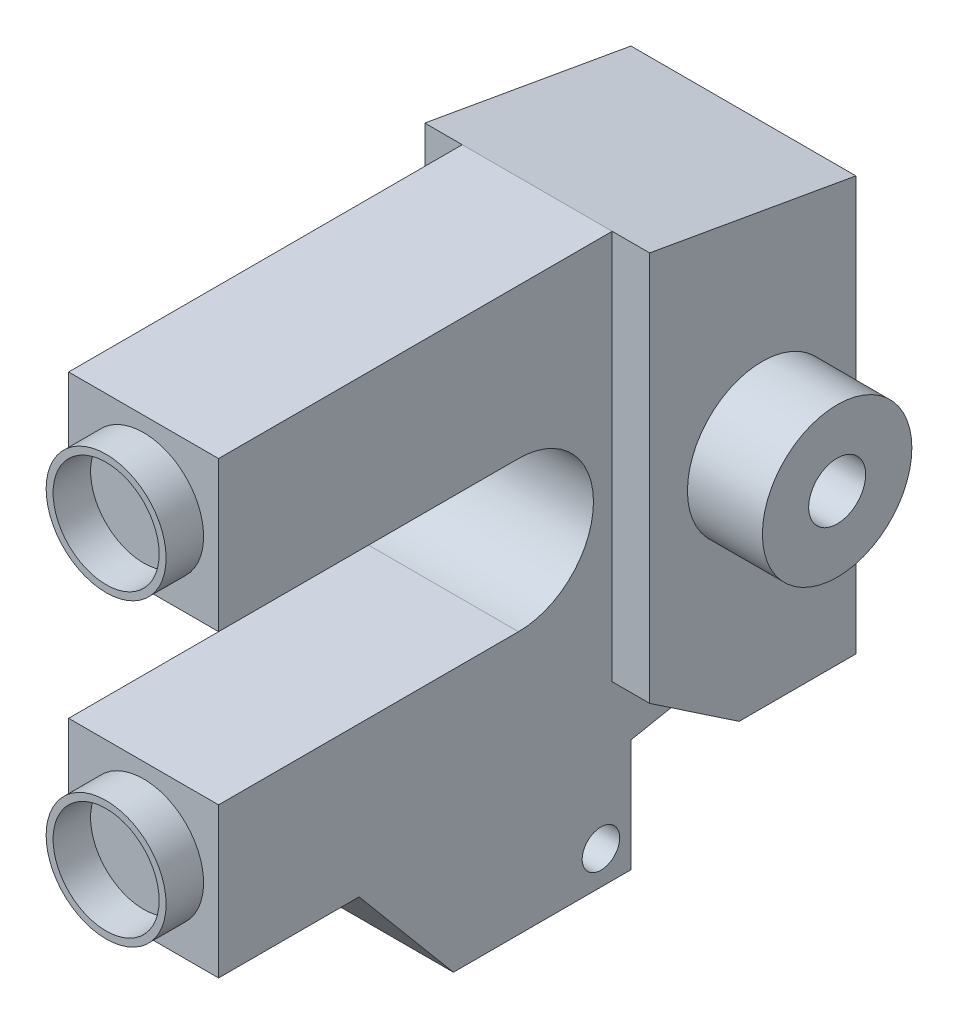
from build123d import *

# Parameters (mm, degrees)
BOSS_EXTRUDE1_DEPTH = 6.35
CUT_EXTRUDE1_DEPTH  = 65.757547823
BOSS_EXTRUDE2_DEPTH = 3.175
SKETCH4_R           = 6.328721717
BOSS_EXTRUDE3_DEPTH = 6.35
SKETCH8_R           = 6.35
BOSS_EXTRUDE5_DEPTH = 6.35
SKETCH9_R           = 2.413
CUT_EXTRUDE4_DEPTH  = 71.995158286
SKETCH12_W          = 6.35
SKETCH12_H          = 12.7
CUT_EXTRUDE5_DEPTH  = 11.1125
SKETCH14_R          = 1.5875
CUT_EXTRUDE6_DEPTH  = 68.277043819
SKETCH15_R          = 5.08
SKETCH15_R_2        = 4.49072
BOSS_EXTRUDE6_DEPTH = 3.175
SKETCH16_R          = 5.08
SKETCH16_R_2        = 4.49072
BOSS_EXTRUDE7_DEPTH = 3.175


with BuildPart() as part:
    # Sketch1 → Boss-Extrude1 (new, symmetric)
    with BuildSketch(Plane(origin=(0, 0, 0), x_dir=(0, 0, -1), z_dir=(1, 0, 0))):
        Polygon((0, 0), (0, 38.1), (33.3375, 38.1), (50.8, 35.020890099), (50.8, 3.085787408), (34.925, 0), (34.925, -9.525), (19.889951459, -9.525), (11.897527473, 0), align=None)
    extrude(amount=BOSS_EXTRUDE1_DEPTH, both=True)

    # Sketch2 → Cut-Extrude1 (cut, through all)
    with BuildSketch(Plane(origin=(6.35, 0, 0), x_dir=(0, 0, -1), z_dir=(1, 0, 0))):
        with BuildLine():
            Line((0, 25.4), (25.4, 25.4))
            ThreePointArc((25.4, 25.4), (31.75, 19.05), (25.4, 12.7))
            Line((25.4, 12.7), (0, 12.7))
            ThreePointArc((0, 12.7), (-6.35, 19.05), (0, 25.4))
        make_face()
    extrude(amount=-CUT_EXTRUDE1_DEPTH, mode=Mode.SUBTRACT)

    # Sketch3 → Boss-Extrude2 (add)
    with BuildSketch(Plane(origin=(6.35, 0, 0), x_dir=(0, 0, -1), z_dir=(1, 0, 0))):
        Polygon((33.3375, 38.1), (33.3375, 5.060292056), (40.906631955, -0.045151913), (50.8, -0.045151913), (50.8, 35.020890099), align=None)
    boss_extrude2 = extrude(amount=BOSS_EXTRUDE2_DEPTH)

    # Sketch4 → Boss-Extrude3 (add)
    with BuildSketch(Plane(origin=(9.525, 0, 0), x_dir=(0, 0, -1), z_dir=(1, 0, 0))):
        with Locations(Location((42.8625, 19.05, 0), (0, 0, 180))):
            Circle(SKETCH4_R)
    extrude(amount=BOSS_EXTRUDE3_DEPTH)

    # Mirror1: Boss-Extrude2 across plane
    add(boss_extrude2.mirror(Plane.ZY))

    # Sketch8 → Boss-Extrude5 (add)
    with BuildSketch(Plane.ZY.offset(9.525)):
        with Locations(Location((-42.8625, 19.05, 0), (0, 0, 180))):
            Circle(SKETCH8_R)
    extrude(amount=BOSS_EXTRUDE5_DEPTH)

    # Sketch9 → Cut-Extrude4 (cut, through all)
    with BuildSketch(Plane.ZY.offset(15.875)):
        with Locations((-42.8625, 19.05)):
            Circle(SKETCH9_R)
    extrude(amount=-CUT_EXTRUDE4_DEPTH, mode=Mode.SUBTRACT)

    # Sketch12 → Cut-Extrude5 (cut)
    with BuildSketch(Plane.XZ.offset(9.525)):
        with Locations((0, -28.575)):
            Rectangle(SKETCH12_W, SKETCH12_H)
    extrude(amount=-CUT_EXTRUDE5_DEPTH, mode=Mode.SUBTRACT)

    # Sketch14 → Cut-Extrude6 (cut, through all)
    with BuildSketch(Plane(origin=(6.35, 0, 0), x_dir=(0, 0, -1), z_dir=(1, 0, 0))):
        with Locations(Location((32.383975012, -6.697965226, 0), (0, 0, 180))):
            Circle(SKETCH14_R)
    extrude(amount=-CUT_EXTRUDE6_DEPTH, mode=Mode.SUBTRACT)

    # Sketch15 → Boss-Extrude6 (add)
    with BuildSketch(Plane.XY):
        with Locations(Location((0, 31.75, 0), (0, 0, 180))):
            Circle(SKETCH15_R)
        with Locations((0, 31.75)):
            Circle(SKETCH15_R_2, mode=Mode.SUBTRACT)
    extrude(amount=BOSS_EXTRUDE6_DEPTH)

    # Sketch16 → Boss-Extrude7 (add)
    with BuildSketch(Plane.XY):
        with Locations(Location((0, 6.35, 0), (0, 0, 180))):
            Circle(SKETCH16_R)
        with Locations((0, 6.35)):
            Circle(SKETCH16_R_2, mode=Mode.SUBTRACT)
    extrude(amount=BOSS_EXTRUDE7_DEPTH)


solid = part.part
